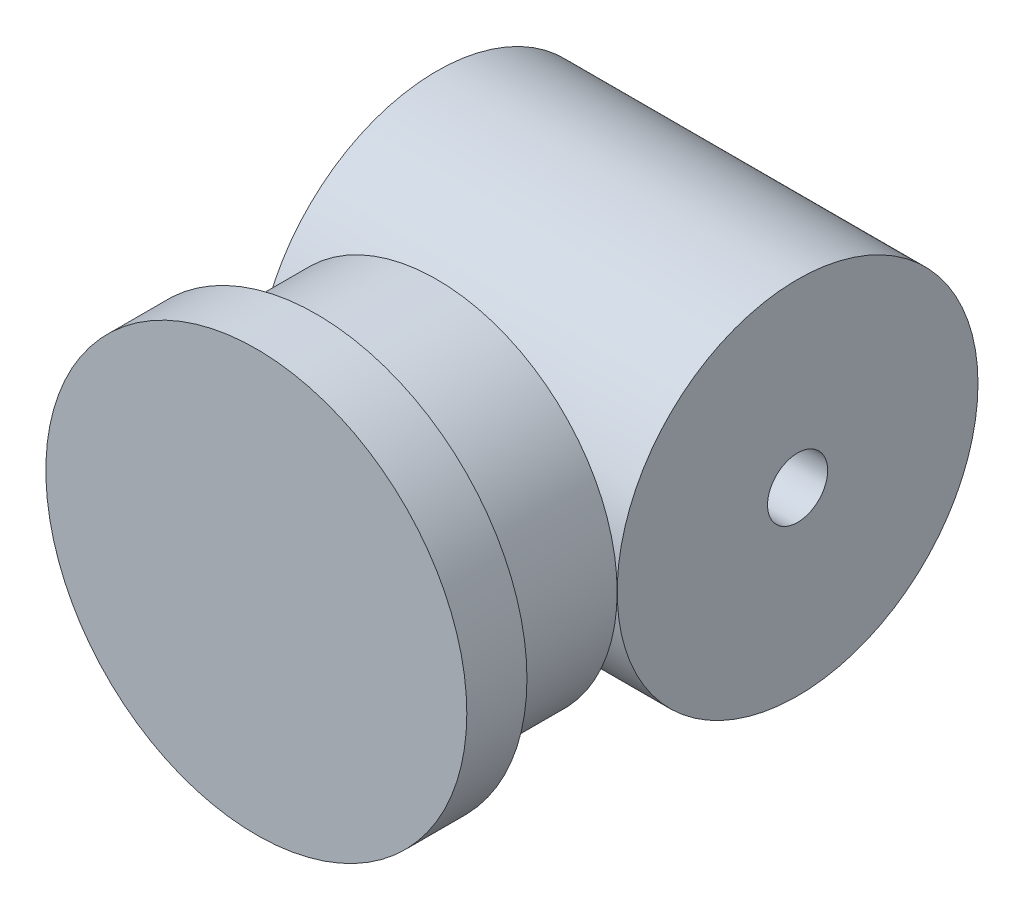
from build123d import *

# Parameters (mm, degrees)
SKETCH1_R           = 30
BOSS_EXTRUDE1_DEPTH = 20
SKETCH2_R           = 35
BOSS_EXTRUDE2_DEPTH = 10
SKETCH3_R           = 30
BOSS_EXTRUDE3_DEPTH = 30
SKETCH4_R           = 5
CUT_EXTRUDE1_DEPTH  = 96.131487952


with BuildPart() as part:
    # Sketch1 → Boss-Extrude1 (new body)
    with BuildSketch(Plane.XY):
        Circle(SKETCH1_R)
    extrude(amount=BOSS_EXTRUDE1_DEPTH)

    # Sketch2 → Boss-Extrude2 (add)
    with BuildSketch(Plane.XY.offset(20)):
        Circle(SKETCH2_R)
    extrude(amount=BOSS_EXTRUDE2_DEPTH)


with BuildPart() as body_2:
    # Sketch3 → Boss-Extrude3 (new, symmetric)
    with BuildSketch(Plane(origin=(0, 0, 0), x_dir=(0, 0, -1), z_dir=(1, 0, 0))):
        with Locations((30, 0)):
            Circle(SKETCH3_R)
    extrude(amount=BOSS_EXTRUDE3_DEPTH, both=True)

    # Sketch4 → Cut-Extrude1 (cut, through all)
    with BuildSketch(Plane(origin=(30, 0, 0), x_dir=(0, 0, -1), z_dir=(1, 0, 0))):
        with Locations((30, 0)):
            Circle(SKETCH4_R)
    extrude(amount=-CUT_EXTRUDE1_DEPTH, mode=Mode.SUBTRACT)


solid = Compound([part.part, body_2.part])
